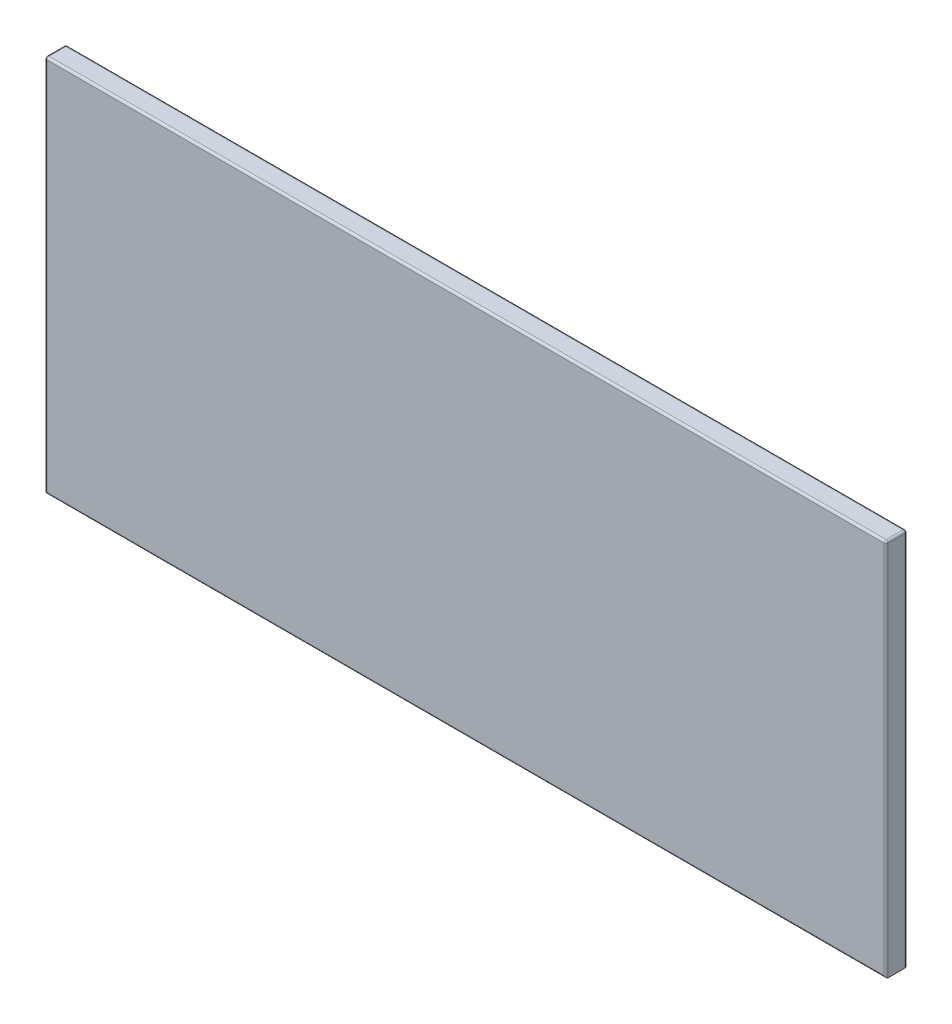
from build123d import *

# Parameters (mm, degrees)
SKETCH1_W           = 1016
SKETCH1_H           = 457.2
BOSS_EXTRUDE1_DEPTH = 25.4
FILLET1_R           = 2.54


with BuildPart() as part:
    # Sketch1 → Boss-Extrude1 (new body)
    with BuildSketch(Plane.XY):
        with Locations((43.344709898, 191.554721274)):
            Rectangle(SKETCH1_W, SKETCH1_H)
    extrude(amount=BOSS_EXTRUDE1_DEPTH)

    # Fillet1
    fillet1_edges = [part.edges().sort_by_distance(p)[0] for p in [
        (551.344709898, 191.554721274, 25.4),
        (43.344709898, 420.154721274, 25.4),
        (-464.655290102, 191.554721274, 25.4),
        (43.344709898, 420.154721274, 0),
        (551.344709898, 191.554721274, 0),
        (43.344709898, -37.045278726, 0),
        (-464.655290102, 191.554721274, 0),
        (-464.655290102, 420.154721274, 12.7),
        (551.344709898, 420.154721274, 12.7),
        (43.344709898, -37.045278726, 25.4),
    ]]
    fillet(fillet1_edges, radius=FILLET1_R)


solid = part.part
